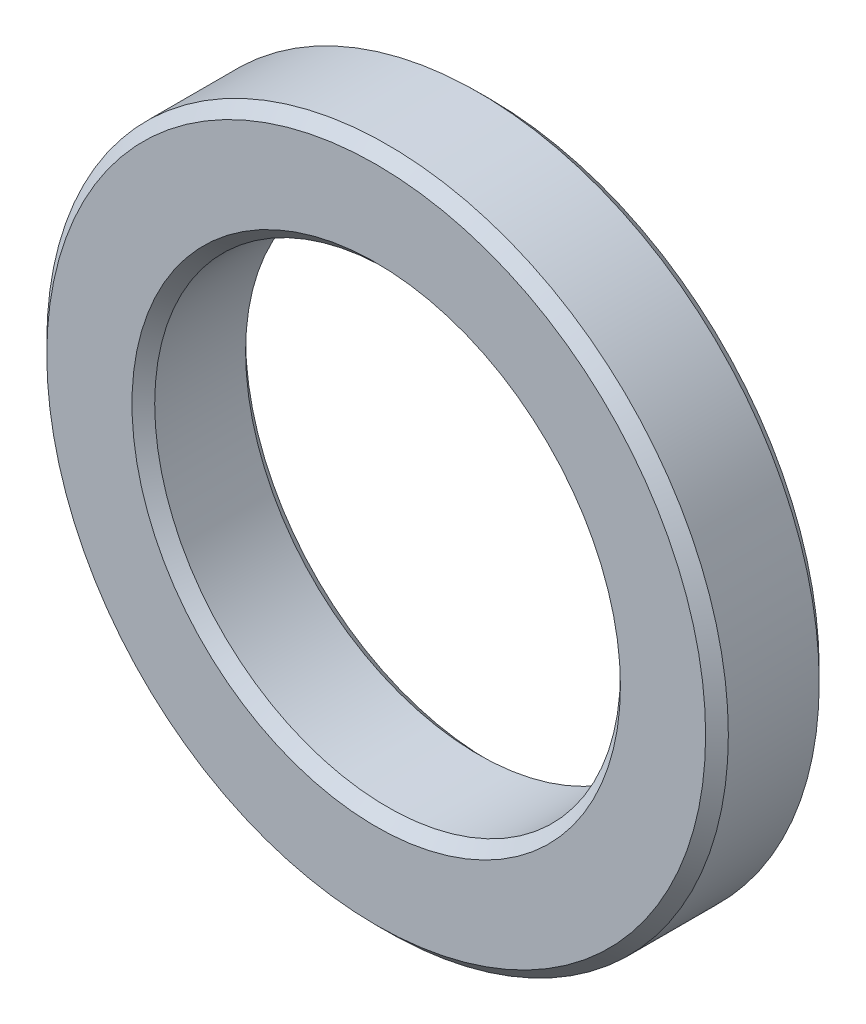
ISO-10303-21;
HEADER;
FILE_DESCRIPTION(('STEP AP214'),'2;1');
FILE_NAME('part.step','',(''),(''),'','','');
FILE_SCHEMA(('AUTOMOTIVE_DESIGN { 1 0 10303 214 1 1 1 1 }'));
ENDSEC;
DATA;
#1=APPLICATION_CONTEXT('core data for automotive mechanical design processes');
#2=APPLICATION_PROTOCOL_DEFINITION('international standard','automotive_design',2000,#1);
#3=PRODUCT_CONTEXT('',#1,'mechanical');
#4=PRODUCT('Part','Part','',(#3));
#5=PRODUCT_RELATED_PRODUCT_CATEGORY('part','',(#4));
#6=PRODUCT_DEFINITION_FORMATION('','',#4);
#7=PRODUCT_DEFINITION_CONTEXT('part definition',#1,'design');
#8=PRODUCT_DEFINITION('design','',#6,#7);
#9=PRODUCT_DEFINITION_SHAPE('','',#8);
#10=(LENGTH_UNIT() NAMED_UNIT(*) SI_UNIT(.MILLI.,.METRE.));
#11=(NAMED_UNIT(*) PLANE_ANGLE_UNIT() SI_UNIT($,.RADIAN.));
#12=(NAMED_UNIT(*) SI_UNIT($,.STERADIAN.) SOLID_ANGLE_UNIT());
#13=UNCERTAINTY_MEASURE_WITH_UNIT(LENGTH_MEASURE(1.E-05),#10,'distance_accuracy_value','');
#14=(GEOMETRIC_REPRESENTATION_CONTEXT(3) GLOBAL_UNCERTAINTY_ASSIGNED_CONTEXT((#13)) GLOBAL_UNIT_ASSIGNED_CONTEXT((#10,
#11,#12)) REPRESENTATION_CONTEXT('',''));
#15=CARTESIAN_POINT('',(0.,0.,0.));
#16=DIRECTION('',(0.,0.,1.));
#17=DIRECTION('',(1.,0.,0.));
#18=AXIS2_PLACEMENT_3D('',#15,#16,#17);
#19=CARTESIAN_POINT('',(0.,0.,1.));
#20=DIRECTION('',(0.,0.,1.));
#21=DIRECTION('',(1.,0.,0.));
#22=AXIS2_PLACEMENT_3D('',#19,#20,#21);
#23=PLANE('',#22);
#24=CARTESIAN_POINT('',(0.,0.,1.));
#25=DIRECTION('',(0.,0.,1.));
#26=DIRECTION('',(1.,0.,0.));
#27=AXIS2_PLACEMENT_3D('',#24,#25,#26);
#28=CIRCLE('',#27,4.3);
#29=CARTESIAN_POINT('',(4.3,0.,1.));
#30=VERTEX_POINT('',#29);
#31=EDGE_CURVE('E10',#30,#30,#28,.F.);
#32=ORIENTED_EDGE('',*,*,#31,.T.);
#33=EDGE_LOOP('',(#32));
#34=FACE_BOUND('',#33,.T.);
#35=CARTESIAN_POINT('',(0.,0.,1.));
#36=DIRECTION('',(0.,0.,1.));
#37=DIRECTION('',(1.,0.,0.));
#38=AXIS2_PLACEMENT_3D('',#35,#36,#37);
#39=CIRCLE('',#38,5.8);
#40=CARTESIAN_POINT('',(5.8,0.,1.));
#41=VERTEX_POINT('',#40);
#42=EDGE_CURVE('E45',#41,#41,#39,.T.);
#43=ORIENTED_EDGE('',*,*,#42,.T.);
#44=EDGE_LOOP('',(#43));
#45=FACE_BOUND('',#44,.T.);
#46=ADVANCED_FACE('F37',(#34,#45),#23,.T.);
#47=CARTESIAN_POINT('',(0.,0.,-1.));
#48=DIRECTION('',(0.,0.,1.));
#49=DIRECTION('',(1.,0.,0.));
#50=AXIS2_PLACEMENT_3D('',#47,#48,#49);
#51=PLANE('',#50);
#52=CARTESIAN_POINT('',(0.,0.,-1.));
#53=DIRECTION('',(0.,0.,1.));
#54=DIRECTION('',(1.,0.,0.));
#55=AXIS2_PLACEMENT_3D('',#52,#53,#54);
#56=CIRCLE('',#55,5.8);
#57=CARTESIAN_POINT('',(5.8,0.,-1.));
#58=VERTEX_POINT('',#57);
#59=EDGE_CURVE('E63',#58,#58,#56,.F.);
#60=ORIENTED_EDGE('',*,*,#59,.T.);
#61=EDGE_LOOP('',(#60));
#62=FACE_BOUND('',#61,.T.);
#63=CARTESIAN_POINT('',(0.,0.,-1.));
#64=DIRECTION('',(0.,0.,1.));
#65=DIRECTION('',(1.,0.,0.));
#66=AXIS2_PLACEMENT_3D('',#63,#64,#65);
#67=CIRCLE('',#66,4.3);
#68=CARTESIAN_POINT('',(-4.3,0.,-1.));
#69=VERTEX_POINT('',#68);
#70=EDGE_CURVE('E67',#69,#69,#67,.T.);
#71=ORIENTED_EDGE('',*,*,#70,.T.);
#72=EDGE_LOOP('',(#71));
#73=FACE_BOUND('',#72,.T.);
#74=ADVANCED_FACE('F89',(#62,#73),#51,.F.);
#75=CARTESIAN_POINT('',(0.,0.,1.));
#76=DIRECTION('',(0.,0.,-1.));
#77=DIRECTION('',(-1.,0.,0.));
#78=AXIS2_PLACEMENT_3D('',#75,#76,#77);
#79=CYLINDRICAL_SURFACE('',#78,6.);
#80=CARTESIAN_POINT('',(0.,0.,-0.799999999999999));
#81=DIRECTION('',(0.,0.,1.));
#82=DIRECTION('',(1.,0.,0.));
#83=AXIS2_PLACEMENT_3D('',#80,#81,#82);
#84=CIRCLE('',#83,6.);
#85=CARTESIAN_POINT('',(6.,0.,-0.799999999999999));
#86=VERTEX_POINT('',#85);
#87=EDGE_CURVE('E70',#86,#86,#84,.T.);
#88=ORIENTED_EDGE('',*,*,#87,.T.);
#89=EDGE_LOOP('',(#88));
#90=FACE_BOUND('',#89,.T.);
#91=CARTESIAN_POINT('',(0.,0.,0.799999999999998));
#92=DIRECTION('',(0.,0.,1.));
#93=DIRECTION('',(1.,0.,0.));
#94=AXIS2_PLACEMENT_3D('',#91,#92,#93);
#95=CIRCLE('',#94,6.);
#96=CARTESIAN_POINT('',(6.,0.,0.799999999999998));
#97=VERTEX_POINT('',#96);
#98=EDGE_CURVE('E74',#97,#97,#95,.F.);
#99=ORIENTED_EDGE('',*,*,#98,.T.);
#100=EDGE_LOOP('',(#99));
#101=FACE_BOUND('',#100,.T.);
#102=ADVANCED_FACE('F78',(#90,#101),#79,.T.);
#103=CARTESIAN_POINT('',(0.,0.,1.));
#104=DIRECTION('',(0.,0.,-1.));
#105=DIRECTION('',(-1.,0.,0.));
#106=AXIS2_PLACEMENT_3D('',#103,#104,#105);
#107=CYLINDRICAL_SURFACE('',#106,4.1);
#108=CARTESIAN_POINT('',(0.,0.,-0.8));
#109=DIRECTION('',(0.,0.,1.));
#110=DIRECTION('',(1.,0.,0.));
#111=AXIS2_PLACEMENT_3D('',#108,#109,#110);
#112=CIRCLE('',#111,4.1);
#113=CARTESIAN_POINT('',(-4.1,0.,-0.8));
#114=VERTEX_POINT('',#113);
#115=EDGE_CURVE('E52',#114,#114,#112,.F.);
#116=ORIENTED_EDGE('',*,*,#115,.T.);
#117=EDGE_LOOP('',(#116));
#118=FACE_BOUND('',#117,.T.);
#119=CARTESIAN_POINT('',(0.,0.,0.800000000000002));
#120=DIRECTION('',(0.,0.,1.));
#121=DIRECTION('',(1.,0.,0.));
#122=AXIS2_PLACEMENT_3D('',#119,#120,#121);
#123=CIRCLE('',#122,4.1);
#124=CARTESIAN_POINT('',(4.1,0.,0.800000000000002));
#125=VERTEX_POINT('',#124);
#126=EDGE_CURVE('E57',#125,#125,#123,.T.);
#127=ORIENTED_EDGE('',*,*,#126,.T.);
#128=EDGE_LOOP('',(#127));
#129=FACE_BOUND('',#128,.T.);
#130=ADVANCED_FACE('F97',(#118,#129),#107,.F.);
#131=CARTESIAN_POINT('',(0.,0.,-0.799999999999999));
#132=DIRECTION('',(0.,0.,1.));
#133=DIRECTION('',(1.,0.,0.));
#134=AXIS2_PLACEMENT_3D('',#131,#132,#133);
#135=CONICAL_SURFACE('',#134,6.,0.78539816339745);
#136=ORIENTED_EDGE('',*,*,#59,.F.);
#137=EDGE_LOOP('',(#136));
#138=FACE_BOUND('',#137,.T.);
#139=ORIENTED_EDGE('',*,*,#87,.F.);
#140=EDGE_LOOP('',(#139));
#141=FACE_BOUND('',#140,.T.);
#142=ADVANCED_FACE('F102',(#138,#141),#135,.T.);
#143=CARTESIAN_POINT('',(0.,0.,-1.));
#144=DIRECTION('',(0.,0.,-1.));
#145=DIRECTION('',(-1.,0.,0.));
#146=AXIS2_PLACEMENT_3D('',#143,#144,#145);
#147=CONICAL_SURFACE('',#146,4.3,0.785398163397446);
#148=CARTESIAN_POINT('',(-4.1,0.,-0.8));
#149=CARTESIAN_POINT('',(-4.10208333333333,0.,-0.802083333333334));
#150=CARTESIAN_POINT('',(-4.10416666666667,0.,-0.804166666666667));
#151=CARTESIAN_POINT('',(-4.10833333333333,0.,-0.808333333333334));
#152=CARTESIAN_POINT('',(-4.11041666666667,0.,-0.810416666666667));
#153=CARTESIAN_POINT('',(-4.11458333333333,0.,-0.814583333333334));
#154=CARTESIAN_POINT('',(-4.11666666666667,0.,-0.816666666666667));
#155=CARTESIAN_POINT('',(-4.12083333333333,0.,-0.820833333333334));
#156=CARTESIAN_POINT('',(-4.12291666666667,0.,-0.822916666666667));
#157=CARTESIAN_POINT('',(-4.12708333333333,0.,-0.827083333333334));
#158=CARTESIAN_POINT('',(-4.12916666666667,0.,-0.829166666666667));
#159=CARTESIAN_POINT('',(-4.13333333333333,0.,-0.833333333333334));
#160=CARTESIAN_POINT('',(-4.13541666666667,0.,-0.835416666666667));
#161=CARTESIAN_POINT('',(-4.13958333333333,0.,-0.839583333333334));
#162=CARTESIAN_POINT('',(-4.14166666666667,0.,-0.841666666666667));
#163=CARTESIAN_POINT('',(-4.14583333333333,0.,-0.845833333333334));
#164=CARTESIAN_POINT('',(-4.14791666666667,0.,-0.847916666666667));
#165=CARTESIAN_POINT('',(-4.15208333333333,0.,-0.852083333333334));
#166=CARTESIAN_POINT('',(-4.15416666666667,0.,-0.854166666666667));
#167=CARTESIAN_POINT('',(-4.15833333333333,0.,-0.858333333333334));
#168=CARTESIAN_POINT('',(-4.16041666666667,0.,-0.860416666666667));
#169=CARTESIAN_POINT('',(-4.16458333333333,0.,-0.864583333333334));
#170=CARTESIAN_POINT('',(-4.16666666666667,0.,-0.866666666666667));
#171=CARTESIAN_POINT('',(-4.17083333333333,0.,-0.870833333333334));
#172=CARTESIAN_POINT('',(-4.17291666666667,0.,-0.872916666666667));
#173=CARTESIAN_POINT('',(-4.17708333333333,0.,-0.877083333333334));
#174=CARTESIAN_POINT('',(-4.17916666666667,0.,-0.879166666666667));
#175=CARTESIAN_POINT('',(-4.18333333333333,0.,-0.883333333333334));
#176=CARTESIAN_POINT('',(-4.18541666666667,0.,-0.885416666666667));
#177=CARTESIAN_POINT('',(-4.18958333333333,0.,-0.889583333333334));
#178=CARTESIAN_POINT('',(-4.19166666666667,0.,-0.891666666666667));
#179=CARTESIAN_POINT('',(-4.19583333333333,0.,-0.895833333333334));
#180=CARTESIAN_POINT('',(-4.19791666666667,0.,-0.897916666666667));
#181=CARTESIAN_POINT('',(-4.20208333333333,0.,-0.902083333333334));
#182=CARTESIAN_POINT('',(-4.20416666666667,0.,-0.904166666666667));
#183=CARTESIAN_POINT('',(-4.20833333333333,0.,-0.908333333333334));
#184=CARTESIAN_POINT('',(-4.21041666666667,0.,-0.910416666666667));
#185=CARTESIAN_POINT('',(-4.21458333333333,0.,-0.914583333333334));
#186=CARTESIAN_POINT('',(-4.21666666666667,0.,-0.916666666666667));
#187=CARTESIAN_POINT('',(-4.22083333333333,0.,-0.920833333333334));
#188=CARTESIAN_POINT('',(-4.22291666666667,0.,-0.922916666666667));
#189=CARTESIAN_POINT('',(-4.22708333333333,0.,-0.927083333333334));
#190=CARTESIAN_POINT('',(-4.22916666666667,0.,-0.929166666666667));
#191=CARTESIAN_POINT('',(-4.23333333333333,0.,-0.933333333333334));
#192=CARTESIAN_POINT('',(-4.23541666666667,0.,-0.935416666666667));
#193=CARTESIAN_POINT('',(-4.23958333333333,0.,-0.939583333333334));
#194=CARTESIAN_POINT('',(-4.24166666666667,0.,-0.941666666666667));
#195=CARTESIAN_POINT('',(-4.24583333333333,0.,-0.945833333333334));
#196=CARTESIAN_POINT('',(-4.24791666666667,0.,-0.947916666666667));
#197=CARTESIAN_POINT('',(-4.25208333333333,0.,-0.952083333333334));
#198=CARTESIAN_POINT('',(-4.25416666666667,0.,-0.954166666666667));
#199=CARTESIAN_POINT('',(-4.25833333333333,0.,-0.958333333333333));
#200=CARTESIAN_POINT('',(-4.26041666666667,0.,-0.960416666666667));
#201=CARTESIAN_POINT('',(-4.26458333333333,0.,-0.964583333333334));
#202=CARTESIAN_POINT('',(-4.26666666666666,0.,-0.966666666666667));
#203=CARTESIAN_POINT('',(-4.27083333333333,0.,-0.970833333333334));
#204=CARTESIAN_POINT('',(-4.27291666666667,0.,-0.972916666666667));
#205=CARTESIAN_POINT('',(-4.27708333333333,0.,-0.977083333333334));
#206=CARTESIAN_POINT('',(-4.27916666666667,0.,-0.979166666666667));
#207=CARTESIAN_POINT('',(-4.28333333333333,0.,-0.983333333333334));
#208=CARTESIAN_POINT('',(-4.28541666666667,0.,-0.985416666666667));
#209=CARTESIAN_POINT('',(-4.28958333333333,0.,-0.989583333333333));
#210=CARTESIAN_POINT('',(-4.29166666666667,0.,-0.991666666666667));
#211=CARTESIAN_POINT('',(-4.29583333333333,0.,-0.995833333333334));
#212=CARTESIAN_POINT('',(-4.29791666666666,0.,-0.997916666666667));
#213=CARTESIAN_POINT('',(-4.3,0.,-1.));
#214=B_SPLINE_CURVE_WITH_KNOTS('',3,(#148,#149,#150,#151,#152,#153,#154,#155,#156,#157,#158,
#159,#160,#161,#162,#163,#164,#165,#166,#167,#168,#169,#170,#171,#172,#173,#174,#175,#176,#177,
#178,#179,#180,#181,#182,#183,#184,#185,#186,#187,#188,#189,#190,#191,#192,#193,#194,#195,#196,
#197,#198,#199,#200,#201,#202,#203,#204,#205,#206,#207,#208,#209,#210,#211,#212,#213),
.UNSPECIFIED.,.F.,.F.,(4,2,2,2,2,2,2,2,2,2,2,2,2,2,2,2,2,2,2,2,2,2,2,2,2,2,2,2,2,2,2,2,4),(0.,
0.00883883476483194,0.0176776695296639,0.0265165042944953,0.0353553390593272,0.0441941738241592,
0.0530330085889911,0.0618718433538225,0.0707106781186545,0.0795495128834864,0.0883883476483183,
0.0972271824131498,0.106066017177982,0.114904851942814,0.123743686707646,0.132582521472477,
0.141421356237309,0.150260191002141,0.159099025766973,0.167937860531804,0.176776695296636,
0.185615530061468,0.1944543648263,0.203293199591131,0.212132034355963,0.220970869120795,
0.229809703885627,0.238648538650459,0.247487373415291,0.256326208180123,0.265165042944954,
0.274003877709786,0.282842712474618),.UNSPECIFIED.);
#215=EDGE_CURVE('BSEAM86',#114,#69,#214,.T.);
#216=ORIENTED_EDGE('',*,*,#115,.F.);
#217=ORIENTED_EDGE('',*,*,#70,.F.);
#218=ORIENTED_EDGE('',*,*,#215,.T.);
#219=ORIENTED_EDGE('',*,*,#215,.F.);
#220=EDGE_LOOP('',(#216,#218,#217,#219));
#221=FACE_BOUND('',#220,.T.);
#222=ADVANCED_FACE('F86',(#221),#147,.F.);
#223=CARTESIAN_POINT('',(0.,0.,0.800000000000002));
#224=DIRECTION('',(0.,0.,1.));
#225=DIRECTION('',(1.,0.,0.));
#226=AXIS2_PLACEMENT_3D('',#223,#224,#225);
#227=CONICAL_SURFACE('',#226,4.1,0.78539816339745);
#228=ORIENTED_EDGE('',*,*,#31,.F.);
#229=EDGE_LOOP('',(#228));
#230=FACE_BOUND('',#229,.T.);
#231=ORIENTED_EDGE('',*,*,#126,.F.);
#232=EDGE_LOOP('',(#231));
#233=FACE_BOUND('',#232,.T.);
#234=ADVANCED_FACE('F82',(#230,#233),#227,.F.);
#235=CARTESIAN_POINT('',(0.,0.,1.));
#236=DIRECTION('',(0.,0.,-1.));
#237=DIRECTION('',(-1.,0.,0.));
#238=AXIS2_PLACEMENT_3D('',#235,#236,#237);
#239=CONICAL_SURFACE('',#238,5.8,0.785398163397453);
#240=ORIENTED_EDGE('',*,*,#98,.F.);
#241=EDGE_LOOP('',(#240));
#242=FACE_BOUND('',#241,.T.);
#243=ORIENTED_EDGE('',*,*,#42,.F.);
#244=EDGE_LOOP('',(#243));
#245=FACE_BOUND('',#244,.T.);
#246=ADVANCED_FACE('F39',(#242,#245),#239,.T.);
#247=CLOSED_SHELL('',(#46,#74,#102,#130,#142,#222,#234,#246));
#248=MANIFOLD_SOLID_BREP('B2',#247);
#249=ADVANCED_BREP_SHAPE_REPRESENTATION('',(#18,#248),#14);
#250=SHAPE_DEFINITION_REPRESENTATION(#9,#249);
ENDSEC;
END-ISO-10303-21;
